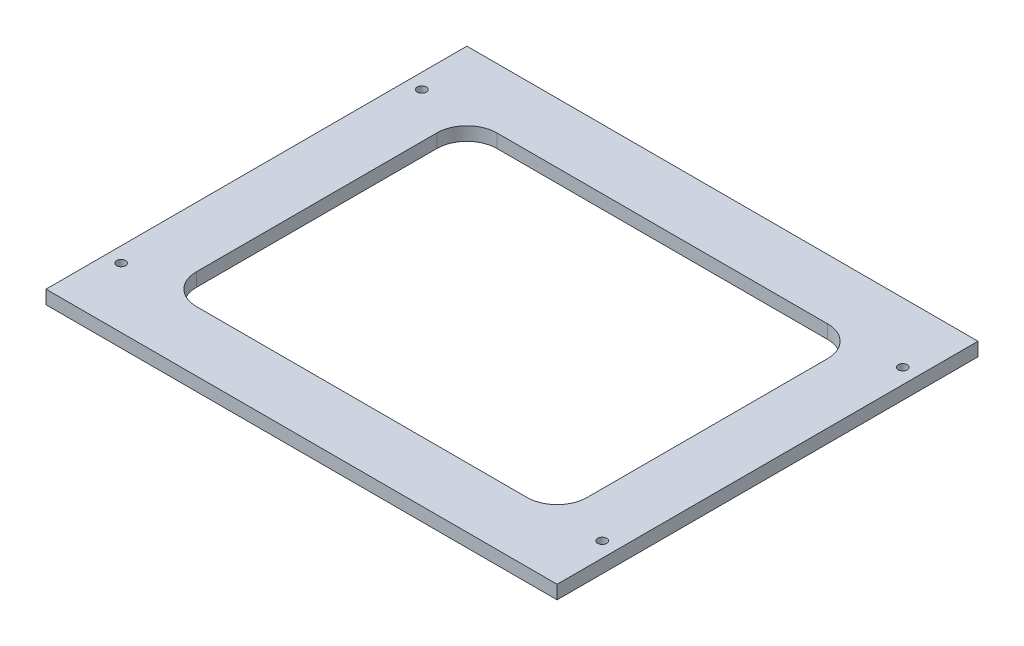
ISO-10303-21;
HEADER;
FILE_DESCRIPTION(('STEP AP214'),'2;1');
FILE_NAME('part.step','',(''),(''),'','','');
FILE_SCHEMA(('AUTOMOTIVE_DESIGN { 1 0 10303 214 1 1 1 1 }'));
ENDSEC;
DATA;
#1=APPLICATION_CONTEXT('core data for automotive mechanical design processes');
#2=APPLICATION_PROTOCOL_DEFINITION('international standard','automotive_design',2000,#1);
#3=PRODUCT_CONTEXT('',#1,'mechanical');
#4=PRODUCT('Part','Part','',(#3));
#5=PRODUCT_RELATED_PRODUCT_CATEGORY('part','',(#4));
#6=PRODUCT_DEFINITION_FORMATION('','',#4);
#7=PRODUCT_DEFINITION_CONTEXT('part definition',#1,'design');
#8=PRODUCT_DEFINITION('design','',#6,#7);
#9=PRODUCT_DEFINITION_SHAPE('','',#8);
#10=(LENGTH_UNIT() NAMED_UNIT(*) SI_UNIT(.MILLI.,.METRE.));
#11=(NAMED_UNIT(*) PLANE_ANGLE_UNIT() SI_UNIT($,.RADIAN.));
#12=(NAMED_UNIT(*) SI_UNIT($,.STERADIAN.) SOLID_ANGLE_UNIT());
#13=UNCERTAINTY_MEASURE_WITH_UNIT(LENGTH_MEASURE(1.E-05),#10,'distance_accuracy_value','');
#14=(GEOMETRIC_REPRESENTATION_CONTEXT(3) GLOBAL_UNCERTAINTY_ASSIGNED_CONTEXT((#13)) GLOBAL_UNIT_ASSIGNED_CONTEXT((#10,
#11,#12)) REPRESENTATION_CONTEXT('',''));
#15=CARTESIAN_POINT('',(0.,0.,0.));
#16=DIRECTION('',(0.,0.,1.));
#17=DIRECTION('',(1.,0.,0.));
#18=AXIS2_PLACEMENT_3D('',#15,#16,#17);
#19=CARTESIAN_POINT('',(-131.363636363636,0.,68.0528255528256));
#20=DIRECTION('',(0.,0.,1.));
#21=DIRECTION('',(1.,0.,0.));
#22=AXIS2_PLACEMENT_3D('',#19,#20,#21);
#23=PLANE('',#22);
#24=DIRECTION('',(1.,0.,0.));
#25=VECTOR('',#24,1.);
#26=CARTESIAN_POINT('',(-131.363636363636,4.5,68.0528255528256));
#27=LINE('',#26,#25);
#28=CARTESIAN_POINT('',(-131.363636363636,4.5,68.0528255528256));
#29=VERTEX_POINT('',#28);
#30=CARTESIAN_POINT('',(38.6363636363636,4.5,68.0528255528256));
#31=VERTEX_POINT('',#30);
#32=EDGE_CURVE('E182',#29,#31,#27,.T.);
#33=ORIENTED_EDGE('',*,*,#32,.F.);
#34=DIRECTION('',(0.,1.,0.));
#35=VECTOR('',#34,1.);
#36=CARTESIAN_POINT('',(-131.363636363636,0.,68.0528255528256));
#37=LINE('',#36,#35);
#38=CARTESIAN_POINT('',(-131.363636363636,0.,68.0528255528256));
#39=VERTEX_POINT('',#38);
#40=EDGE_CURVE('E11',#39,#29,#37,.T.);
#41=ORIENTED_EDGE('',*,*,#40,.F.);
#42=DIRECTION('',(1.,0.,0.));
#43=VECTOR('',#42,1.);
#44=CARTESIAN_POINT('',(-131.363636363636,0.,68.0528255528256));
#45=LINE('',#44,#43);
#46=CARTESIAN_POINT('',(38.6363636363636,0.,68.0528255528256));
#47=VERTEX_POINT('',#46);
#48=EDGE_CURVE('E194',#39,#47,#45,.T.);
#49=ORIENTED_EDGE('',*,*,#48,.T.);
#50=DIRECTION('',(0.,1.,0.));
#51=VECTOR('',#50,1.);
#52=CARTESIAN_POINT('',(38.6363636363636,0.,68.0528255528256));
#53=LINE('',#52,#51);
#54=EDGE_CURVE('E36',#47,#31,#53,.T.);
#55=ORIENTED_EDGE('',*,*,#54,.T.);
#56=EDGE_LOOP('',(#33,#41,#49,#55));
#57=FACE_BOUND('',#56,.T.);
#58=ADVANCED_FACE('F33',(#57),#23,.T.);
#59=CARTESIAN_POINT('',(-131.363636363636,0.,-71.9471744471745));
#60=DIRECTION('',(-1.,0.,0.));
#61=DIRECTION('',(0.,0.,1.));
#62=AXIS2_PLACEMENT_3D('',#59,#60,#61);
#63=PLANE('',#62);
#64=DIRECTION('',(0.,0.,1.));
#65=VECTOR('',#64,1.);
#66=CARTESIAN_POINT('',(-131.363636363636,4.5,-71.9471744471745));
#67=LINE('',#66,#65);
#68=CARTESIAN_POINT('',(-131.363636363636,4.5,-71.9471744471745));
#69=VERTEX_POINT('',#68);
#70=EDGE_CURVE('E198',#69,#29,#67,.T.);
#71=ORIENTED_EDGE('',*,*,#70,.F.);
#72=DIRECTION('',(0.,1.,0.));
#73=VECTOR('',#72,1.);
#74=CARTESIAN_POINT('',(-131.363636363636,0.,-71.9471744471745));
#75=LINE('',#74,#73);
#76=CARTESIAN_POINT('',(-131.363636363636,0.,-71.9471744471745));
#77=VERTEX_POINT('',#76);
#78=EDGE_CURVE('E41',#77,#69,#75,.T.);
#79=ORIENTED_EDGE('',*,*,#78,.F.);
#80=DIRECTION('',(0.,0.,1.));
#81=VECTOR('',#80,1.);
#82=CARTESIAN_POINT('',(-131.363636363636,0.,-71.9471744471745));
#83=LINE('',#82,#81);
#84=EDGE_CURVE('E204',#77,#39,#83,.T.);
#85=ORIENTED_EDGE('',*,*,#84,.T.);
#86=ORIENTED_EDGE('',*,*,#40,.T.);
#87=EDGE_LOOP('',(#71,#79,#85,#86));
#88=FACE_BOUND('',#87,.T.);
#89=ADVANCED_FACE('F230',(#88),#63,.T.);
#90=CARTESIAN_POINT('',(38.6363636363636,0.,-71.9471744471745));
#91=DIRECTION('',(0.,0.,-1.));
#92=DIRECTION('',(-1.,0.,0.));
#93=AXIS2_PLACEMENT_3D('',#90,#91,#92);
#94=PLANE('',#93);
#95=DIRECTION('',(-1.,0.,0.));
#96=VECTOR('',#95,1.);
#97=CARTESIAN_POINT('',(38.6363636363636,4.5,-71.9471744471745));
#98=LINE('',#97,#96);
#99=CARTESIAN_POINT('',(38.6363636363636,4.5,-71.9471744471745));
#100=VERTEX_POINT('',#99);
#101=EDGE_CURVE('E212',#100,#69,#98,.T.);
#102=ORIENTED_EDGE('',*,*,#101,.F.);
#103=DIRECTION('',(0.,1.,0.));
#104=VECTOR('',#103,1.);
#105=CARTESIAN_POINT('',(38.6363636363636,0.,-71.9471744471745));
#106=LINE('',#105,#104);
#107=CARTESIAN_POINT('',(38.6363636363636,0.,-71.9471744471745));
#108=VERTEX_POINT('',#107);
#109=EDGE_CURVE('E217',#108,#100,#106,.T.);
#110=ORIENTED_EDGE('',*,*,#109,.F.);
#111=DIRECTION('',(-1.,0.,0.));
#112=VECTOR('',#111,1.);
#113=CARTESIAN_POINT('',(38.6363636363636,0.,-71.9471744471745));
#114=LINE('',#113,#112);
#115=EDGE_CURVE('E201',#108,#77,#114,.T.);
#116=ORIENTED_EDGE('',*,*,#115,.T.);
#117=ORIENTED_EDGE('',*,*,#78,.T.);
#118=EDGE_LOOP('',(#102,#110,#116,#117));
#119=FACE_BOUND('',#118,.T.);
#120=ADVANCED_FACE('F234',(#119),#94,.T.);
#121=CARTESIAN_POINT('',(38.6363636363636,0.,68.0528255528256));
#122=DIRECTION('',(1.,0.,0.));
#123=DIRECTION('',(0.,0.,-1.));
#124=AXIS2_PLACEMENT_3D('',#121,#122,#123);
#125=PLANE('',#124);
#126=DIRECTION('',(0.,0.,-1.));
#127=VECTOR('',#126,1.);
#128=CARTESIAN_POINT('',(38.6363636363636,4.5,68.0528255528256));
#129=LINE('',#128,#127);
#130=EDGE_CURVE('E209',#31,#100,#129,.T.);
#131=ORIENTED_EDGE('',*,*,#130,.F.);
#132=ORIENTED_EDGE('',*,*,#54,.F.);
#133=DIRECTION('',(0.,0.,-1.));
#134=VECTOR('',#133,1.);
#135=CARTESIAN_POINT('',(38.6363636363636,0.,68.0528255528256));
#136=LINE('',#135,#134);
#137=EDGE_CURVE('E197',#47,#108,#136,.T.);
#138=ORIENTED_EDGE('',*,*,#137,.T.);
#139=ORIENTED_EDGE('',*,*,#109,.T.);
#140=EDGE_LOOP('',(#131,#132,#138,#139));
#141=FACE_BOUND('',#140,.T.);
#142=ADVANCED_FACE('F225',(#141),#125,.T.);
#143=CARTESIAN_POINT('',(0.,0.,0.));
#144=DIRECTION('',(0.,1.,0.));
#145=DIRECTION('',(0.,0.,1.));
#146=AXIS2_PLACEMENT_3D('',#143,#144,#145);
#147=PLANE('',#146);
#148=CARTESIAN_POINT('',(-126.363636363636,0.,48.0528255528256));
#149=DIRECTION('',(0.,1.,0.));
#150=DIRECTION('',(0.,0.,1.));
#151=AXIS2_PLACEMENT_3D('',#148,#149,#150);
#152=CIRCLE('',#151,1.5);
#153=CARTESIAN_POINT('',(-126.363636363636,0.,49.5528255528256));
#154=VERTEX_POINT('',#153);
#155=EDGE_CURVE('E402',#154,#154,#152,.F.);
#156=ORIENTED_EDGE('',*,*,#155,.F.);
#157=EDGE_LOOP('',(#156));
#158=FACE_BOUND('',#157,.T.);
#159=CARTESIAN_POINT('',(33.6363636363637,0.,48.0528255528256));
#160=DIRECTION('',(0.,1.,0.));
#161=DIRECTION('',(0.,0.,1.));
#162=AXIS2_PLACEMENT_3D('',#159,#160,#161);
#163=CIRCLE('',#162,1.5);
#164=CARTESIAN_POINT('',(33.6363636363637,0.,49.5528255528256));
#165=VERTEX_POINT('',#164);
#166=EDGE_CURVE('E406',#165,#165,#163,.F.);
#167=ORIENTED_EDGE('',*,*,#166,.F.);
#168=EDGE_LOOP('',(#167));
#169=FACE_BOUND('',#168,.T.);
#170=CARTESIAN_POINT('',(33.6363636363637,0.,-51.9471744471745));
#171=DIRECTION('',(0.,1.,0.));
#172=DIRECTION('',(0.,0.,1.));
#173=AXIS2_PLACEMENT_3D('',#170,#171,#172);
#174=CIRCLE('',#173,1.5);
#175=CARTESIAN_POINT('',(33.6363636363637,0.,-50.4471744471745));
#176=VERTEX_POINT('',#175);
#177=EDGE_CURVE('E415',#176,#176,#174,.F.);
#178=ORIENTED_EDGE('',*,*,#177,.F.);
#179=EDGE_LOOP('',(#178));
#180=FACE_BOUND('',#179,.T.);
#181=CARTESIAN_POINT('',(-126.363636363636,0.,-51.9471744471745));
#182=DIRECTION('',(0.,1.,0.));
#183=DIRECTION('',(0.,0.,1.));
#184=AXIS2_PLACEMENT_3D('',#181,#182,#183);
#185=CIRCLE('',#184,1.5);
#186=CARTESIAN_POINT('',(-126.363636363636,0.,-50.4471744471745));
#187=VERTEX_POINT('',#186);
#188=EDGE_CURVE('E147',#187,#187,#185,.F.);
#189=ORIENTED_EDGE('',*,*,#188,.F.);
#190=EDGE_LOOP('',(#189));
#191=FACE_BOUND('',#190,.T.);
#192=DIRECTION('',(1.,0.,0.));
#193=VECTOR('',#192,1.);
#194=CARTESIAN_POINT('',(8.63636363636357,0.,48.0528255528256));
#195=LINE('',#194,#193);
#196=CARTESIAN_POINT('',(-101.363636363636,0.,48.0528255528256));
#197=VERTEX_POINT('',#196);
#198=CARTESIAN_POINT('',(8.63636363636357,0.,48.0528255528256));
#199=VERTEX_POINT('',#198);
#200=EDGE_CURVE('E130',#197,#199,#195,.T.);
#201=ORIENTED_EDGE('',*,*,#200,.T.);
#202=CARTESIAN_POINT('',(8.63636363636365,0.,38.0528255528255));
#203=DIRECTION('',(0.,1.,0.));
#204=DIRECTION('',(0.,0.,-1.));
#205=AXIS2_PLACEMENT_3D('',#202,#203,#204);
#206=CIRCLE('',#205,10.);
#207=CARTESIAN_POINT('',(18.6363636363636,0.,38.0528255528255));
#208=VERTEX_POINT('',#207);
#209=EDGE_CURVE('E124',#199,#208,#206,.T.);
#210=ORIENTED_EDGE('',*,*,#209,.T.);
#211=DIRECTION('',(0.,0.,-1.));
#212=VECTOR('',#211,1.);
#213=CARTESIAN_POINT('',(18.6363636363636,0.,-41.9471744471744));
#214=LINE('',#213,#212);
#215=CARTESIAN_POINT('',(18.6363636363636,0.,-41.9471744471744));
#216=VERTEX_POINT('',#215);
#217=EDGE_CURVE('E133',#208,#216,#214,.T.);
#218=ORIENTED_EDGE('',*,*,#217,.T.);
#219=CARTESIAN_POINT('',(8.63636363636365,0.,-41.9471744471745));
#220=DIRECTION('',(0.,1.,0.));
#221=DIRECTION('',(0.,0.,-1.));
#222=AXIS2_PLACEMENT_3D('',#219,#220,#221);
#223=CIRCLE('',#222,10.);
#224=CARTESIAN_POINT('',(8.63636363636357,0.,-51.9471744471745));
#225=VERTEX_POINT('',#224);
#226=EDGE_CURVE('E49',#216,#225,#223,.T.);
#227=ORIENTED_EDGE('',*,*,#226,.T.);
#228=DIRECTION('',(-1.,0.,0.));
#229=VECTOR('',#228,1.);
#230=CARTESIAN_POINT('',(-101.363636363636,0.,-51.9471744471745));
#231=LINE('',#230,#229);
#232=CARTESIAN_POINT('',(-101.363636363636,0.,-51.9471744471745));
#233=VERTEX_POINT('',#232);
#234=EDGE_CURVE('E151',#225,#233,#231,.T.);
#235=ORIENTED_EDGE('',*,*,#234,.T.);
#236=CARTESIAN_POINT('',(-101.363636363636,0.,-41.9471744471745));
#237=DIRECTION('',(0.,1.,0.));
#238=DIRECTION('',(0.,0.,-1.));
#239=AXIS2_PLACEMENT_3D('',#236,#237,#238);
#240=CIRCLE('',#239,10.);
#241=CARTESIAN_POINT('',(-111.363636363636,0.,-41.9471744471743));
#242=VERTEX_POINT('',#241);
#243=EDGE_CURVE('E154',#233,#242,#240,.T.);
#244=ORIENTED_EDGE('',*,*,#243,.T.);
#245=DIRECTION('',(0.,0.,1.));
#246=VECTOR('',#245,1.);
#247=CARTESIAN_POINT('',(-111.363636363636,0.,38.0528255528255));
#248=LINE('',#247,#246);
#249=CARTESIAN_POINT('',(-111.363636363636,0.,38.0528255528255));
#250=VERTEX_POINT('',#249);
#251=EDGE_CURVE('E157',#242,#250,#248,.T.);
#252=ORIENTED_EDGE('',*,*,#251,.T.);
#253=CARTESIAN_POINT('',(-101.363636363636,0.,38.0528255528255));
#254=DIRECTION('',(0.,1.,0.));
#255=DIRECTION('',(0.,0.,-1.));
#256=AXIS2_PLACEMENT_3D('',#253,#254,#255);
#257=CIRCLE('',#256,10.);
#258=EDGE_CURVE('E160',#250,#197,#257,.T.);
#259=ORIENTED_EDGE('',*,*,#258,.T.);
#260=EDGE_LOOP('',(#201,#210,#218,#227,#235,#244,#252,#259));
#261=FACE_BOUND('',#260,.T.);
#262=ORIENTED_EDGE('',*,*,#48,.F.);
#263=ORIENTED_EDGE('',*,*,#84,.F.);
#264=ORIENTED_EDGE('',*,*,#115,.F.);
#265=ORIENTED_EDGE('',*,*,#137,.F.);
#266=EDGE_LOOP('',(#262,#263,#264,#265));
#267=FACE_BOUND('',#266,.T.);
#268=ADVANCED_FACE('F137',(#158,#169,#180,#191,#261,#267),#147,.F.);
#269=CARTESIAN_POINT('',(0.,4.5,0.));
#270=DIRECTION('',(0.,1.,0.));
#271=DIRECTION('',(0.,0.,1.));
#272=AXIS2_PLACEMENT_3D('',#269,#270,#271);
#273=PLANE('',#272);
#274=CARTESIAN_POINT('',(-126.363636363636,4.5,48.0528255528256));
#275=DIRECTION('',(0.,1.,0.));
#276=DIRECTION('',(0.,0.,1.));
#277=AXIS2_PLACEMENT_3D('',#274,#275,#276);
#278=CIRCLE('',#277,1.5);
#279=CARTESIAN_POINT('',(-126.363636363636,4.5,49.5528255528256));
#280=VERTEX_POINT('',#279);
#281=EDGE_CURVE('E399',#280,#280,#278,.T.);
#282=ORIENTED_EDGE('',*,*,#281,.F.);
#283=EDGE_LOOP('',(#282));
#284=FACE_BOUND('',#283,.T.);
#285=CARTESIAN_POINT('',(33.6363636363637,4.5,48.0528255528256));
#286=DIRECTION('',(0.,1.,0.));
#287=DIRECTION('',(0.,0.,1.));
#288=AXIS2_PLACEMENT_3D('',#285,#286,#287);
#289=CIRCLE('',#288,1.5);
#290=CARTESIAN_POINT('',(33.6363636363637,4.5,49.5528255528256));
#291=VERTEX_POINT('',#290);
#292=EDGE_CURVE('E403',#291,#291,#289,.T.);
#293=ORIENTED_EDGE('',*,*,#292,.F.);
#294=EDGE_LOOP('',(#293));
#295=FACE_BOUND('',#294,.T.);
#296=CARTESIAN_POINT('',(33.6363636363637,4.5,-51.9471744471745));
#297=DIRECTION('',(0.,1.,0.));
#298=DIRECTION('',(0.,0.,1.));
#299=AXIS2_PLACEMENT_3D('',#296,#297,#298);
#300=CIRCLE('',#299,1.5);
#301=CARTESIAN_POINT('',(33.6363636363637,4.5,-50.4471744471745));
#302=VERTEX_POINT('',#301);
#303=EDGE_CURVE('E412',#302,#302,#300,.T.);
#304=ORIENTED_EDGE('',*,*,#303,.F.);
#305=EDGE_LOOP('',(#304));
#306=FACE_BOUND('',#305,.T.);
#307=CARTESIAN_POINT('',(-126.363636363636,4.5,-51.9471744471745));
#308=DIRECTION('',(0.,1.,0.));
#309=DIRECTION('',(0.,0.,1.));
#310=AXIS2_PLACEMENT_3D('',#307,#308,#309);
#311=CIRCLE('',#310,1.5);
#312=CARTESIAN_POINT('',(-126.363636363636,4.5,-50.4471744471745));
#313=VERTEX_POINT('',#312);
#314=EDGE_CURVE('E417',#313,#313,#311,.T.);
#315=ORIENTED_EDGE('',*,*,#314,.F.);
#316=EDGE_LOOP('',(#315));
#317=FACE_BOUND('',#316,.T.);
#318=CARTESIAN_POINT('',(8.63636363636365,4.5,38.0528255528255));
#319=DIRECTION('',(0.,1.,0.));
#320=DIRECTION('',(0.,0.,-1.));
#321=AXIS2_PLACEMENT_3D('',#318,#319,#320);
#322=CIRCLE('',#321,10.);
#323=CARTESIAN_POINT('',(8.63636363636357,4.5,48.0528255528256));
#324=VERTEX_POINT('',#323);
#325=CARTESIAN_POINT('',(18.6363636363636,4.5,38.0528255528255));
#326=VERTEX_POINT('',#325);
#327=EDGE_CURVE('E57',#324,#326,#322,.T.);
#328=ORIENTED_EDGE('',*,*,#327,.F.);
#329=DIRECTION('',(1.,0.,0.));
#330=VECTOR('',#329,1.);
#331=CARTESIAN_POINT('',(8.63636363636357,4.5,48.0528255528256));
#332=LINE('',#331,#330);
#333=CARTESIAN_POINT('',(-101.363636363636,4.5,48.0528255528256));
#334=VERTEX_POINT('',#333);
#335=EDGE_CURVE('E141',#334,#324,#332,.T.);
#336=ORIENTED_EDGE('',*,*,#335,.F.);
#337=CARTESIAN_POINT('',(-101.363636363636,4.5,38.0528255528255));
#338=DIRECTION('',(0.,1.,0.));
#339=DIRECTION('',(0.,0.,-1.));
#340=AXIS2_PLACEMENT_3D('',#337,#338,#339);
#341=CIRCLE('',#340,10.);
#342=CARTESIAN_POINT('',(-111.363636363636,4.5,38.0528255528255));
#343=VERTEX_POINT('',#342);
#344=EDGE_CURVE('E144',#343,#334,#341,.T.);
#345=ORIENTED_EDGE('',*,*,#344,.F.);
#346=DIRECTION('',(0.,0.,1.));
#347=VECTOR('',#346,1.);
#348=CARTESIAN_POINT('',(-111.363636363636,4.5,38.0528255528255));
#349=LINE('',#348,#347);
#350=CARTESIAN_POINT('',(-111.363636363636,4.5,-41.9471744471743));
#351=VERTEX_POINT('',#350);
#352=EDGE_CURVE('E175',#351,#343,#349,.T.);
#353=ORIENTED_EDGE('',*,*,#352,.F.);
#354=CARTESIAN_POINT('',(-101.363636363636,4.5,-41.9471744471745));
#355=DIRECTION('',(0.,1.,0.));
#356=DIRECTION('',(0.,0.,-1.));
#357=AXIS2_PLACEMENT_3D('',#354,#355,#356);
#358=CIRCLE('',#357,10.);
#359=CARTESIAN_POINT('',(-101.363636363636,4.5,-51.9471744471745));
#360=VERTEX_POINT('',#359);
#361=EDGE_CURVE('E172',#360,#351,#358,.T.);
#362=ORIENTED_EDGE('',*,*,#361,.F.);
#363=DIRECTION('',(-1.,0.,0.));
#364=VECTOR('',#363,1.);
#365=CARTESIAN_POINT('',(-101.363636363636,4.5,-51.9471744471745));
#366=LINE('',#365,#364);
#367=CARTESIAN_POINT('',(8.63636363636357,4.5,-51.9471744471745));
#368=VERTEX_POINT('',#367);
#369=EDGE_CURVE('E169',#368,#360,#366,.T.);
#370=ORIENTED_EDGE('',*,*,#369,.F.);
#371=CARTESIAN_POINT('',(8.63636363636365,4.5,-41.9471744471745));
#372=DIRECTION('',(0.,1.,0.));
#373=DIRECTION('',(0.,0.,-1.));
#374=AXIS2_PLACEMENT_3D('',#371,#372,#373);
#375=CIRCLE('',#374,10.);
#376=CARTESIAN_POINT('',(18.6363636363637,4.5,-41.9471744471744));
#377=VERTEX_POINT('',#376);
#378=EDGE_CURVE('E166',#377,#368,#375,.T.);
#379=ORIENTED_EDGE('',*,*,#378,.F.);
#380=DIRECTION('',(0.,0.,-1.));
#381=VECTOR('',#380,1.);
#382=CARTESIAN_POINT('',(18.6363636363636,4.5,-41.9471744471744));
#383=LINE('',#382,#381);
#384=EDGE_CURVE('E164',#326,#377,#383,.T.);
#385=ORIENTED_EDGE('',*,*,#384,.F.);
#386=EDGE_LOOP('',(#328,#336,#345,#353,#362,#370,#379,#385));
#387=FACE_BOUND('',#386,.T.);
#388=ORIENTED_EDGE('',*,*,#32,.T.);
#389=ORIENTED_EDGE('',*,*,#130,.T.);
#390=ORIENTED_EDGE('',*,*,#101,.T.);
#391=ORIENTED_EDGE('',*,*,#70,.T.);
#392=EDGE_LOOP('',(#388,#389,#390,#391));
#393=FACE_BOUND('',#392,.T.);
#394=ADVANCED_FACE('F227',(#284,#295,#306,#317,#387,#393),#273,.T.);
#395=CARTESIAN_POINT('',(8.63636363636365,0.,38.0528255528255));
#396=DIRECTION('',(0.,1.,0.));
#397=DIRECTION('',(0.,0.,1.));
#398=AXIS2_PLACEMENT_3D('',#395,#396,#397);
#399=CYLINDRICAL_SURFACE('',#398,10.);
#400=ORIENTED_EDGE('',*,*,#327,.T.);
#401=DIRECTION('',(0.,1.,0.));
#402=VECTOR('',#401,1.);
#403=CARTESIAN_POINT('',(18.6363636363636,0.,38.0528255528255));
#404=LINE('',#403,#402);
#405=EDGE_CURVE('E120',#208,#326,#404,.T.);
#406=ORIENTED_EDGE('',*,*,#405,.F.);
#407=ORIENTED_EDGE('',*,*,#209,.F.);
#408=DIRECTION('',(0.,1.,0.));
#409=VECTOR('',#408,1.);
#410=CARTESIAN_POINT('',(8.63636363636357,0.,48.0528255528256));
#411=LINE('',#410,#409);
#412=EDGE_CURVE('E180',#199,#324,#411,.T.);
#413=ORIENTED_EDGE('',*,*,#412,.T.);
#414=EDGE_LOOP('',(#400,#406,#407,#413));
#415=FACE_BOUND('',#414,.T.);
#416=ADVANCED_FACE('F122',(#415),#399,.F.);
#417=CARTESIAN_POINT('',(8.63636363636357,0.,48.0528255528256));
#418=DIRECTION('',(0.,0.,1.));
#419=DIRECTION('',(1.,0.,0.));
#420=AXIS2_PLACEMENT_3D('',#417,#418,#419);
#421=PLANE('',#420);
#422=ORIENTED_EDGE('',*,*,#335,.T.);
#423=ORIENTED_EDGE('',*,*,#412,.F.);
#424=ORIENTED_EDGE('',*,*,#200,.F.);
#425=DIRECTION('',(0.,1.,0.));
#426=VECTOR('',#425,1.);
#427=CARTESIAN_POINT('',(-101.363636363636,0.,48.0528255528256));
#428=LINE('',#427,#426);
#429=EDGE_CURVE('E183',#197,#334,#428,.T.);
#430=ORIENTED_EDGE('',*,*,#429,.T.);
#431=EDGE_LOOP('',(#422,#423,#424,#430));
#432=FACE_BOUND('',#431,.T.);
#433=ADVANCED_FACE('F270',(#432),#421,.F.);
#434=CARTESIAN_POINT('',(-101.363636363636,0.,38.0528255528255));
#435=DIRECTION('',(0.,1.,0.));
#436=DIRECTION('',(0.,0.,1.));
#437=AXIS2_PLACEMENT_3D('',#434,#435,#436);
#438=CYLINDRICAL_SURFACE('',#437,10.);
#439=ORIENTED_EDGE('',*,*,#344,.T.);
#440=ORIENTED_EDGE('',*,*,#429,.F.);
#441=ORIENTED_EDGE('',*,*,#258,.F.);
#442=DIRECTION('',(0.,1.,0.));
#443=VECTOR('',#442,1.);
#444=CARTESIAN_POINT('',(-111.363636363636,0.,38.0528255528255));
#445=LINE('',#444,#443);
#446=EDGE_CURVE('E185',#250,#343,#445,.T.);
#447=ORIENTED_EDGE('',*,*,#446,.T.);
#448=EDGE_LOOP('',(#439,#440,#441,#447));
#449=FACE_BOUND('',#448,.T.);
#450=ADVANCED_FACE('F281',(#449),#438,.F.);
#451=CARTESIAN_POINT('',(-111.363636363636,0.,38.0528255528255));
#452=DIRECTION('',(-1.,0.,0.));
#453=DIRECTION('',(0.,0.,1.));
#454=AXIS2_PLACEMENT_3D('',#451,#452,#453);
#455=PLANE('',#454);
#456=ORIENTED_EDGE('',*,*,#352,.T.);
#457=ORIENTED_EDGE('',*,*,#446,.F.);
#458=ORIENTED_EDGE('',*,*,#251,.F.);
#459=DIRECTION('',(0.,1.,0.));
#460=VECTOR('',#459,1.);
#461=CARTESIAN_POINT('',(-111.363636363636,0.,-41.9471744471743));
#462=LINE('',#461,#460);
#463=EDGE_CURVE('E187',#242,#351,#462,.T.);
#464=ORIENTED_EDGE('',*,*,#463,.T.);
#465=EDGE_LOOP('',(#456,#457,#458,#464));
#466=FACE_BOUND('',#465,.T.);
#467=ADVANCED_FACE('F291',(#466),#455,.F.);
#468=CARTESIAN_POINT('',(-101.363636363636,0.,-41.9471744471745));
#469=DIRECTION('',(0.,1.,0.));
#470=DIRECTION('',(0.,0.,1.));
#471=AXIS2_PLACEMENT_3D('',#468,#469,#470);
#472=CYLINDRICAL_SURFACE('',#471,10.);
#473=ORIENTED_EDGE('',*,*,#361,.T.);
#474=ORIENTED_EDGE('',*,*,#463,.F.);
#475=ORIENTED_EDGE('',*,*,#243,.F.);
#476=DIRECTION('',(0.,1.,0.));
#477=VECTOR('',#476,1.);
#478=CARTESIAN_POINT('',(-101.363636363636,0.,-51.9471744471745));
#479=LINE('',#478,#477);
#480=EDGE_CURVE('E189',#233,#360,#479,.T.);
#481=ORIENTED_EDGE('',*,*,#480,.T.);
#482=EDGE_LOOP('',(#473,#474,#475,#481));
#483=FACE_BOUND('',#482,.T.);
#484=ADVANCED_FACE('F301',(#483),#472,.F.);
#485=CARTESIAN_POINT('',(-101.363636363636,0.,-51.9471744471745));
#486=DIRECTION('',(0.,0.,-1.));
#487=DIRECTION('',(-1.,0.,0.));
#488=AXIS2_PLACEMENT_3D('',#485,#486,#487);
#489=PLANE('',#488);
#490=ORIENTED_EDGE('',*,*,#369,.T.);
#491=ORIENTED_EDGE('',*,*,#480,.F.);
#492=ORIENTED_EDGE('',*,*,#234,.F.);
#493=DIRECTION('',(0.,1.,0.));
#494=VECTOR('',#493,1.);
#495=CARTESIAN_POINT('',(8.63636363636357,0.,-51.9471744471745));
#496=LINE('',#495,#494);
#497=EDGE_CURVE('E191',#225,#368,#496,.T.);
#498=ORIENTED_EDGE('',*,*,#497,.T.);
#499=EDGE_LOOP('',(#490,#491,#492,#498));
#500=FACE_BOUND('',#499,.T.);
#501=ADVANCED_FACE('F311',(#500),#489,.F.);
#502=CARTESIAN_POINT('',(8.63636363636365,0.,-41.9471744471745));
#503=DIRECTION('',(0.,1.,0.));
#504=DIRECTION('',(0.,0.,1.));
#505=AXIS2_PLACEMENT_3D('',#502,#503,#504);
#506=CYLINDRICAL_SURFACE('',#505,10.);
#507=ORIENTED_EDGE('',*,*,#378,.T.);
#508=ORIENTED_EDGE('',*,*,#497,.F.);
#509=ORIENTED_EDGE('',*,*,#226,.F.);
#510=DIRECTION('',(0.,1.,0.));
#511=VECTOR('',#510,1.);
#512=CARTESIAN_POINT('',(18.6363636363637,0.,-41.9471744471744));
#513=LINE('',#512,#511);
#514=EDGE_CURVE('E129',#216,#377,#513,.T.);
#515=ORIENTED_EDGE('',*,*,#514,.T.);
#516=EDGE_LOOP('',(#507,#508,#509,#515));
#517=FACE_BOUND('',#516,.T.);
#518=ADVANCED_FACE('F321',(#517),#506,.F.);
#519=CARTESIAN_POINT('',(18.6363636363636,0.,-41.9471744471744));
#520=DIRECTION('',(1.,0.,0.));
#521=DIRECTION('',(0.,0.,-1.));
#522=AXIS2_PLACEMENT_3D('',#519,#520,#521);
#523=PLANE('',#522);
#524=ORIENTED_EDGE('',*,*,#384,.T.);
#525=ORIENTED_EDGE('',*,*,#514,.F.);
#526=ORIENTED_EDGE('',*,*,#217,.F.);
#527=ORIENTED_EDGE('',*,*,#405,.T.);
#528=EDGE_LOOP('',(#524,#525,#526,#527));
#529=FACE_BOUND('',#528,.T.);
#530=ADVANCED_FACE('F134',(#529),#523,.F.);
#531=CARTESIAN_POINT('',(-126.363636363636,-0.001000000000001,-51.9471744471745));
#532=DIRECTION('',(0.,1.,0.));
#533=DIRECTION('',(0.,0.,1.));
#534=AXIS2_PLACEMENT_3D('',#531,#532,#533);
#535=CYLINDRICAL_SURFACE('',#534,1.5);
#536=ORIENTED_EDGE('',*,*,#314,.T.);
#537=EDGE_LOOP('',(#536));
#538=FACE_BOUND('',#537,.T.);
#539=ORIENTED_EDGE('',*,*,#188,.T.);
#540=EDGE_LOOP('',(#539));
#541=FACE_BOUND('',#540,.T.);
#542=ADVANCED_FACE('F339',(#538,#541),#535,.F.);
#543=CARTESIAN_POINT('',(33.6363636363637,-0.001000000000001,-51.9471744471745));
#544=DIRECTION('',(0.,1.,0.));
#545=DIRECTION('',(0.,0.,1.));
#546=AXIS2_PLACEMENT_3D('',#543,#544,#545);
#547=CYLINDRICAL_SURFACE('',#546,1.5);
#548=ORIENTED_EDGE('',*,*,#303,.T.);
#549=EDGE_LOOP('',(#548));
#550=FACE_BOUND('',#549,.T.);
#551=ORIENTED_EDGE('',*,*,#177,.T.);
#552=EDGE_LOOP('',(#551));
#553=FACE_BOUND('',#552,.T.);
#554=ADVANCED_FACE('F362',(#550,#553),#547,.F.);
#555=CARTESIAN_POINT('',(33.6363636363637,-0.001000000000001,48.0528255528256));
#556=DIRECTION('',(0.,1.,0.));
#557=DIRECTION('',(0.,0.,1.));
#558=AXIS2_PLACEMENT_3D('',#555,#556,#557);
#559=CYLINDRICAL_SURFACE('',#558,1.5);
#560=ORIENTED_EDGE('',*,*,#292,.T.);
#561=EDGE_LOOP('',(#560));
#562=FACE_BOUND('',#561,.T.);
#563=ORIENTED_EDGE('',*,*,#166,.T.);
#564=EDGE_LOOP('',(#563));
#565=FACE_BOUND('',#564,.T.);
#566=ADVANCED_FACE('F372',(#562,#565),#559,.F.);
#567=CARTESIAN_POINT('',(-126.363636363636,-0.001000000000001,48.0528255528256));
#568=DIRECTION('',(0.,1.,0.));
#569=DIRECTION('',(0.,0.,1.));
#570=AXIS2_PLACEMENT_3D('',#567,#568,#569);
#571=CYLINDRICAL_SURFACE('',#570,1.5);
#572=ORIENTED_EDGE('',*,*,#281,.T.);
#573=EDGE_LOOP('',(#572));
#574=FACE_BOUND('',#573,.T.);
#575=ORIENTED_EDGE('',*,*,#155,.T.);
#576=EDGE_LOOP('',(#575));
#577=FACE_BOUND('',#576,.T.);
#578=ADVANCED_FACE('F382',(#574,#577),#571,.F.);
#579=CLOSED_SHELL('',(#58,#89,#120,#142,#268,#394,#416,#433,#450,#467,#484,#501,#518,#530,#542,
#554,#566,#578));
#580=MANIFOLD_SOLID_BREP('B2',#579);
#581=ADVANCED_BREP_SHAPE_REPRESENTATION('',(#18,#580),#14);
#582=SHAPE_DEFINITION_REPRESENTATION(#9,#581);
ENDSEC;
END-ISO-10303-21;
